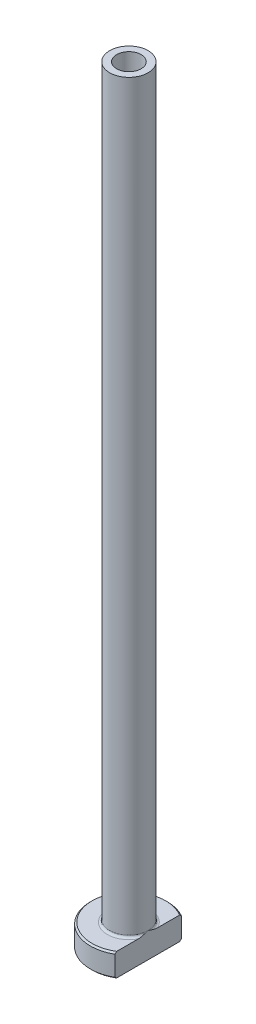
ISO-10303-21;
HEADER;
FILE_DESCRIPTION(('STEP AP214'),'2;1');
FILE_NAME('part.step','',(''),(''),'','','');
FILE_SCHEMA(('AUTOMOTIVE_DESIGN { 1 0 10303 214 1 1 1 1 }'));
ENDSEC;
DATA;
#1=APPLICATION_CONTEXT('core data for automotive mechanical design processes');
#2=APPLICATION_PROTOCOL_DEFINITION('international standard','automotive_design',2000,#1);
#3=PRODUCT_CONTEXT('',#1,'mechanical');
#4=PRODUCT('Part','Part','',(#3));
#5=PRODUCT_RELATED_PRODUCT_CATEGORY('part','',(#4));
#6=PRODUCT_DEFINITION_FORMATION('','',#4);
#7=PRODUCT_DEFINITION_CONTEXT('part definition',#1,'design');
#8=PRODUCT_DEFINITION('design','',#6,#7);
#9=PRODUCT_DEFINITION_SHAPE('','',#8);
#10=(LENGTH_UNIT() NAMED_UNIT(*) SI_UNIT(.MILLI.,.METRE.));
#11=(NAMED_UNIT(*) PLANE_ANGLE_UNIT() SI_UNIT($,.RADIAN.));
#12=(NAMED_UNIT(*) SI_UNIT($,.STERADIAN.) SOLID_ANGLE_UNIT());
#13=UNCERTAINTY_MEASURE_WITH_UNIT(LENGTH_MEASURE(1.E-05),#10,'distance_accuracy_value','');
#14=(GEOMETRIC_REPRESENTATION_CONTEXT(3) GLOBAL_UNCERTAINTY_ASSIGNED_CONTEXT((#13)) GLOBAL_UNIT_ASSIGNED_CONTEXT((#10,
#11,#12)) REPRESENTATION_CONTEXT('',''));
#15=CARTESIAN_POINT('',(0.,0.,0.));
#16=DIRECTION('',(0.,0.,1.));
#17=DIRECTION('',(1.,0.,0.));
#18=AXIS2_PLACEMENT_3D('',#15,#16,#17);
#19=CARTESIAN_POINT('',(0.,92.1876809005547,0.));
#20=DIRECTION('',(0.,1.,0.));
#21=DIRECTION('',(0.,0.,1.));
#22=AXIS2_PLACEMENT_3D('',#19,#20,#21);
#23=CYLINDRICAL_SURFACE('',#22,1.60000000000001);
#24=CARTESIAN_POINT('',(0.,100.,0.));
#25=DIRECTION('',(0.,1.,0.));
#26=DIRECTION('',(0.,0.,1.));
#27=AXIS2_PLACEMENT_3D('',#24,#25,#26);
#28=CIRCLE('',#27,1.60000000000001);
#29=CARTESIAN_POINT('',(0.,100.,1.60000000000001));
#30=VERTEX_POINT('',#29);
#31=EDGE_CURVE('E167',#30,#30,#28,.T.);
#32=ORIENTED_EDGE('',*,*,#31,.T.);
#33=EDGE_LOOP('',(#32));
#34=FACE_BOUND('',#33,.T.);
#35=CARTESIAN_POINT('',(0.,55.,0.));
#36=DIRECTION('',(0.,1.,0.));
#37=DIRECTION('',(0.,0.,1.));
#38=AXIS2_PLACEMENT_3D('',#35,#36,#37);
#39=CIRCLE('',#38,1.60000000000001);
#40=CARTESIAN_POINT('',(0.,55.,1.60000000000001));
#41=VERTEX_POINT('',#40);
#42=EDGE_CURVE('E170',#41,#41,#39,.T.);
#43=ORIENTED_EDGE('',*,*,#42,.F.);
#44=EDGE_LOOP('',(#43));
#45=FACE_BOUND('',#44,.T.);
#46=ADVANCED_FACE('F32',(#34,#45),#23,.F.);
#47=CARTESIAN_POINT('',(-1.60000000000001,100.,0.));
#48=DIRECTION('',(0.,1.,0.));
#49=DIRECTION('',(0.,0.,1.));
#50=AXIS2_PLACEMENT_3D('',#47,#48,#49);
#51=PLANE('',#50);
#52=CARTESIAN_POINT('',(0.,100.,0.));
#53=DIRECTION('',(0.,1.,0.));
#54=DIRECTION('',(0.,0.,1.));
#55=AXIS2_PLACEMENT_3D('',#52,#53,#54);
#56=CIRCLE('',#55,2.5);
#57=CARTESIAN_POINT('',(0.,100.,2.5));
#58=VERTEX_POINT('',#57);
#59=EDGE_CURVE('E174',#58,#58,#56,.T.);
#60=ORIENTED_EDGE('',*,*,#59,.T.);
#61=EDGE_LOOP('',(#60));
#62=FACE_BOUND('',#61,.T.);
#63=ORIENTED_EDGE('',*,*,#31,.F.);
#64=EDGE_LOOP('',(#63));
#65=FACE_BOUND('',#64,.T.);
#66=ADVANCED_FACE('F157',(#62,#65),#51,.T.);
#67=CARTESIAN_POINT('',(0.,92.1876809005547,0.));
#68=DIRECTION('',(0.,1.,0.));
#69=DIRECTION('',(0.,0.,1.));
#70=AXIS2_PLACEMENT_3D('',#67,#68,#69);
#71=CYLINDRICAL_SURFACE('',#70,2.49999999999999);
#72=CARTESIAN_POINT('',(0.,3.3,0.));
#73=DIRECTION('',(0.,1.,0.));
#74=DIRECTION('',(0.,0.,1.));
#75=AXIS2_PLACEMENT_3D('',#72,#73,#74);
#76=CIRCLE('',#75,2.49999999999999);
#77=CARTESIAN_POINT('',(2.49999999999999,3.3,0.));
#78=VERTEX_POINT('',#77);
#79=EDGE_CURVE('E180',#78,#78,#76,.T.);
#80=ORIENTED_EDGE('',*,*,#79,.T.);
#81=EDGE_LOOP('',(#80));
#82=FACE_BOUND('',#81,.T.);
#83=ORIENTED_EDGE('',*,*,#59,.F.);
#84=EDGE_LOOP('',(#83));
#85=FACE_BOUND('',#84,.T.);
#86=ADVANCED_FACE('F162',(#82,#85),#71,.T.);
#87=CARTESIAN_POINT('',(-2.49999999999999,3.,0.));
#88=DIRECTION('',(0.,1.,0.));
#89=DIRECTION('',(0.,0.,1.));
#90=AXIS2_PLACEMENT_3D('',#87,#88,#89);
#91=PLANE('',#90);
#92=DIRECTION('',(0.,0.,1.));
#93=VECTOR('',#92,1.);
#94=CARTESIAN_POINT('',(2.49999999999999,3.,0.));
#95=LINE('',#94,#93);
#96=CARTESIAN_POINT('',(2.49999999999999,3.,-4.09756024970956));
#97=VERTEX_POINT('',#96);
#98=CARTESIAN_POINT('',(2.49999999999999,3.,-1.26095202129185));
#99=VERTEX_POINT('',#98);
#100=EDGE_CURVE('E54',#97,#99,#95,.T.);
#101=ORIENTED_EDGE('',*,*,#100,.F.);
#102=CARTESIAN_POINT('',(0.,3.,0.));
#103=DIRECTION('',(0.,1.,0.));
#104=DIRECTION('',(0.,0.,1.));
#105=AXIS2_PLACEMENT_3D('',#102,#103,#104);
#106=CIRCLE('',#105,4.79999999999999);
#107=CARTESIAN_POINT('',(2.49999999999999,3.,4.09756024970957));
#108=VERTEX_POINT('',#107);
#109=EDGE_CURVE('E186',#97,#108,#106,.T.);
#110=ORIENTED_EDGE('',*,*,#109,.T.);
#111=CARTESIAN_POINT('',(2.49999999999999,3.,1.26095202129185));
#112=VERTEX_POINT('',#111);
#113=EDGE_CURVE('E134',#112,#108,#95,.T.);
#114=ORIENTED_EDGE('',*,*,#113,.F.);
#115=CARTESIAN_POINT('',(0.,3.,0.));
#116=DIRECTION('',(0.,1.,0.));
#117=DIRECTION('',(0.,0.,1.));
#118=AXIS2_PLACEMENT_3D('',#115,#116,#117);
#119=CIRCLE('',#118,2.79999999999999);
#120=EDGE_CURVE('E183',#112,#99,#119,.F.);
#121=ORIENTED_EDGE('',*,*,#120,.T.);
#122=EDGE_LOOP('',(#101,#110,#114,#121));
#123=FACE_BOUND('',#122,.T.);
#124=ADVANCED_FACE('F197',(#123),#91,.T.);
#125=CARTESIAN_POINT('',(0.,92.1876809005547,0.));
#126=DIRECTION('',(0.,1.,0.));
#127=DIRECTION('',(0.,0.,1.));
#128=AXIS2_PLACEMENT_3D('',#125,#126,#127);
#129=CYLINDRICAL_SURFACE('',#128,4.99999999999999);
#130=DIRECTION('',(0.,-1.,0.));
#131=VECTOR('',#130,1.);
#132=CARTESIAN_POINT('',(2.49999999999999,100.,4.33012701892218));
#133=LINE('',#132,#131);
#134=CARTESIAN_POINT('',(2.49999999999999,2.80000000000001,4.33012701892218));
#135=VERTEX_POINT('',#134);
#136=CARTESIAN_POINT('',(2.49999999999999,0.200000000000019,4.33012701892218));
#137=VERTEX_POINT('',#136);
#138=EDGE_CURVE('E82',#135,#137,#133,.T.);
#139=ORIENTED_EDGE('',*,*,#138,.F.);
#140=CARTESIAN_POINT('',(0.,2.80000000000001,0.));
#141=DIRECTION('',(0.,1.,0.));
#142=DIRECTION('',(0.,0.,1.));
#143=AXIS2_PLACEMENT_3D('',#140,#141,#142);
#144=CIRCLE('',#143,4.99999999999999);
#145=CARTESIAN_POINT('',(2.49999999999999,2.80000000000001,-4.33012701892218));
#146=VERTEX_POINT('',#145);
#147=EDGE_CURVE('E95',#135,#146,#144,.F.);
#148=ORIENTED_EDGE('',*,*,#147,.T.);
#149=DIRECTION('',(0.,-1.,0.));
#150=VECTOR('',#149,1.);
#151=CARTESIAN_POINT('',(2.49999999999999,100.,-4.33012701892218));
#152=LINE('',#151,#150);
#153=CARTESIAN_POINT('',(2.49999999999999,0.20000000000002,-4.33012701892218));
#154=VERTEX_POINT('',#153);
#155=EDGE_CURVE('E192',#146,#154,#152,.T.);
#156=ORIENTED_EDGE('',*,*,#155,.T.);
#157=CARTESIAN_POINT('',(0.,0.20000000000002,0.));
#158=DIRECTION('',(0.,-1.,0.));
#159=DIRECTION('',(0.,0.,-1.));
#160=AXIS2_PLACEMENT_3D('',#157,#158,#159);
#161=CIRCLE('',#160,4.99999999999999);
#162=EDGE_CURVE('E98',#154,#137,#161,.F.);
#163=ORIENTED_EDGE('',*,*,#162,.T.);
#164=EDGE_LOOP('',(#139,#148,#156,#163));
#165=FACE_BOUND('',#164,.T.);
#166=ADVANCED_FACE('F190',(#165),#129,.T.);
#167=CARTESIAN_POINT('',(-4.99999999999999,0.,0.));
#168=DIRECTION('',(0.,-1.,0.));
#169=DIRECTION('',(0.,0.,-1.));
#170=AXIS2_PLACEMENT_3D('',#167,#168,#169);
#171=PLANE('',#170);
#172=CARTESIAN_POINT('',(0.,0.,0.));
#173=DIRECTION('',(0.,-1.,0.));
#174=DIRECTION('',(0.,0.,-1.));
#175=AXIS2_PLACEMENT_3D('',#172,#173,#174);
#176=CIRCLE('',#175,2.34999999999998);
#177=CARTESIAN_POINT('',(0.,0.,-2.34999999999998));
#178=VERTEX_POINT('',#177);
#179=EDGE_CURVE('E40',#178,#178,#176,.F.);
#180=ORIENTED_EDGE('',*,*,#179,.T.);
#181=EDGE_LOOP('',(#180));
#182=FACE_BOUND('',#181,.T.);
#183=DIRECTION('',(0.,0.,-1.));
#184=VECTOR('',#183,1.);
#185=CARTESIAN_POINT('',(2.49999999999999,0.,4.33012701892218));
#186=LINE('',#185,#184);
#187=CARTESIAN_POINT('',(2.49999999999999,0.,4.09756024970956));
#188=VERTEX_POINT('',#187);
#189=CARTESIAN_POINT('',(2.49999999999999,0.,-4.09756024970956));
#190=VERTEX_POINT('',#189);
#191=EDGE_CURVE('E47',#188,#190,#186,.T.);
#192=ORIENTED_EDGE('',*,*,#191,.F.);
#193=CARTESIAN_POINT('',(0.,0.,0.));
#194=DIRECTION('',(0.,-1.,0.));
#195=DIRECTION('',(0.,0.,-1.));
#196=AXIS2_PLACEMENT_3D('',#193,#194,#195);
#197=CIRCLE('',#196,4.79999999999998);
#198=EDGE_CURVE('E92',#188,#190,#197,.T.);
#199=ORIENTED_EDGE('',*,*,#198,.T.);
#200=EDGE_LOOP('',(#192,#199));
#201=FACE_BOUND('',#200,.T.);
#202=ADVANCED_FACE('F91',(#182,#201),#171,.T.);
#203=CARTESIAN_POINT('',(0.,92.1876809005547,0.));
#204=DIRECTION('',(0.,1.,0.));
#205=DIRECTION('',(0.,0.,1.));
#206=AXIS2_PLACEMENT_3D('',#203,#204,#205);
#207=CYLINDRICAL_SURFACE('',#206,1.84999999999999);
#208=CARTESIAN_POINT('',(0.,0.499999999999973,0.));
#209=DIRECTION('',(0.,-1.,0.));
#210=DIRECTION('',(0.,0.,-1.));
#211=AXIS2_PLACEMENT_3D('',#208,#209,#210);
#212=CIRCLE('',#211,1.84999999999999);
#213=CARTESIAN_POINT('',(0.,0.499999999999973,-1.84999999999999));
#214=VERTEX_POINT('',#213);
#215=EDGE_CURVE('E11',#214,#214,#212,.T.);
#216=ORIENTED_EDGE('',*,*,#215,.T.);
#217=EDGE_LOOP('',(#216));
#218=FACE_BOUND('',#217,.T.);
#219=CARTESIAN_POINT('',(0.,43.,0.));
#220=DIRECTION('',(0.,1.,0.));
#221=DIRECTION('',(0.,0.,1.));
#222=AXIS2_PLACEMENT_3D('',#219,#220,#221);
#223=CIRCLE('',#222,1.85);
#224=CARTESIAN_POINT('',(0.,43.,1.85));
#225=VERTEX_POINT('',#224);
#226=EDGE_CURVE('E172',#225,#225,#223,.T.);
#227=ORIENTED_EDGE('',*,*,#226,.T.);
#228=EDGE_LOOP('',(#227));
#229=FACE_BOUND('',#228,.T.);
#230=ADVANCED_FACE('F215',(#218,#229),#207,.F.);
#231=CARTESIAN_POINT('',(0.,43.,0.));
#232=DIRECTION('',(0.,-1.,0.));
#233=DIRECTION('',(0.,0.,-1.));
#234=AXIS2_PLACEMENT_3D('',#231,#232,#233);
#235=CONICAL_SURFACE('',#234,1.85,0.020830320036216);
#236=ORIENTED_EDGE('',*,*,#42,.T.);
#237=EDGE_LOOP('',(#236));
#238=FACE_BOUND('',#237,.T.);
#239=ORIENTED_EDGE('',*,*,#226,.F.);
#240=EDGE_LOOP('',(#239));
#241=FACE_BOUND('',#240,.T.);
#242=ADVANCED_FACE('F111',(#238,#241),#235,.F.);
#243=CARTESIAN_POINT('',(0.,3.3,0.));
#244=DIRECTION('',(0.,1.,0.));
#245=DIRECTION('',(0.,0.,1.));
#246=AXIS2_PLACEMENT_3D('',#243,#244,#245);
#247=TOROIDAL_SURFACE('',#246,2.79999999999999,0.3);
#248=ORIENTED_EDGE('',*,*,#120,.F.);
#249=CARTESIAN_POINT('',(2.49999999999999,3.3,0.));
#250=CARTESIAN_POINT('',(2.49999999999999,3.30000062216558,-4.84266777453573E-11));
#251=CARTESIAN_POINT('',(2.49999999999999,3.3000012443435,1.59620968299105E-07));
#252=CARTESIAN_POINT('',(2.49999999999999,3.3000024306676,6.45477755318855E-07));
#253=CARTESIAN_POINT('',(2.49999999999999,3.30000299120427,9.78480438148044E-07));
#254=CARTESIAN_POINT('',(2.49999999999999,3.30000411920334,1.77471942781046E-06));
#255=CARTESIAN_POINT('',(2.49999999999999,3.30000467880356,2.24902099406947E-06));
#256=CARTESIAN_POINT('',(2.49999999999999,3.30000572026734,3.25953628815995E-06));
#257=CARTESIAN_POINT('',(2.49999999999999,3.30000620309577,3.79480690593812E-06));
#258=CARTESIAN_POINT('',(2.49999999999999,3.30000787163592,5.75794557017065E-06));
#259=CARTESIAN_POINT('',(2.49999999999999,3.30000896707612,7.2642403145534E-06));
#260=CARTESIAN_POINT('',(2.49999999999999,3.30001087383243,1.0336112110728E-05));
#261=CARTESIAN_POINT('',(2.49999999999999,3.30001169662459,1.18949491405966E-05));
#262=CARTESIAN_POINT('',(2.49999999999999,3.30001489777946,1.81400839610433E-05));
#263=CARTESIAN_POINT('',(2.49999999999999,3.30001712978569,2.29062162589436E-05));
#264=CARTESIAN_POINT('',(2.49999999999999,3.30002067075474,3.21793848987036E-05));
#265=CARTESIAN_POINT('',(2.49999999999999,3.30002205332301,3.66588971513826E-05));
#266=CARTESIAN_POINT('',(2.49999999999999,3.30002810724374,5.61718377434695E-05));
#267=CARTESIAN_POINT('',(2.49999999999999,3.30003284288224,7.11735829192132E-05));
#268=CARTESIAN_POINT('',(2.49999999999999,3.30004025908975,9.89920283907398E-05));
#269=CARTESIAN_POINT('',(2.49999999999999,3.3000431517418,0.000111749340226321));
#270=CARTESIAN_POINT('',(2.49999999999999,3.30006652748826,0.000206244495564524));
#271=CARTESIAN_POINT('',(2.49999999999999,3.3000969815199,0.00028511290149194));
#272=CARTESIAN_POINT('',(2.49999999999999,3.30021213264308,0.000594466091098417));
#273=CARTESIAN_POINT('',(2.49999999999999,3.30028938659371,0.000826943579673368));
#274=CARTESIAN_POINT('',(2.49999999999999,3.30059681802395,0.00173885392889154));
#275=CARTESIAN_POINT('',(2.49999999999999,3.3008347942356,0.00241625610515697));
#276=CARTESIAN_POINT('',(2.49999999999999,3.3018119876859,0.00521069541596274));
#277=CARTESIAN_POINT('',(2.49999999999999,3.30254240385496,0.00732996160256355));
#278=CARTESIAN_POINT('',(2.49999999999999,3.3122604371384,0.0355096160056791));
#279=CARTESIAN_POINT('',(2.49999999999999,3.32130808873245,0.0615551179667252));
#280=CARTESIAN_POINT('',(2.49999999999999,3.33896212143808,0.11267798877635));
#281=CARTESIAN_POINT('',(2.49999999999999,3.34757212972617,0.137754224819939));
#282=CARTESIAN_POINT('',(2.49999999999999,3.36573068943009,0.190981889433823));
#283=CARTESIAN_POINT('',(2.49999999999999,3.37526654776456,0.219137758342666));
#284=CARTESIAN_POINT('',(2.49999999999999,3.39422867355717,0.275816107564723));
#285=CARTESIAN_POINT('',(2.49999999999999,3.40365272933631,0.304339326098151));
#286=CARTESIAN_POINT('',(2.49999999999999,3.42641697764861,0.374416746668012));
#287=CARTESIAN_POINT('',(2.49999999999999,3.43959811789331,0.416023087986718));
#288=CARTESIAN_POINT('',(2.49999999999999,3.46479157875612,0.498481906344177));
#289=CARTESIAN_POINT('',(2.49999999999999,3.4768245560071,0.539328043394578));
#290=CARTESIAN_POINT('',(2.49999999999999,3.50224427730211,0.629981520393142));
#291=CARTESIAN_POINT('',(2.49999999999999,3.51538048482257,0.679860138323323));
#292=CARTESIAN_POINT('',(2.49999999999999,3.53964074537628,0.780511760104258));
#293=CARTESIAN_POINT('',(2.49999999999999,3.55074877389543,0.831288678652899));
#294=CARTESIAN_POINT('',(2.49999999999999,3.57087054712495,0.937063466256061));
#295=CARTESIAN_POINT('',(2.49999999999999,3.57967623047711,0.992102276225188));
#296=CARTESIAN_POINT('',(2.49999999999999,3.59301148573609,1.10256024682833));
#297=CARTESIAN_POINT('',(2.49999999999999,3.59755297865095,1.1579779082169));
#298=CARTESIAN_POINT('',(2.49999999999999,3.60093314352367,1.26786705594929));
#299=CARTESIAN_POINT('',(2.49999999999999,3.59989366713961,1.32233291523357));
#300=CARTESIAN_POINT('',(2.49999999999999,3.59277279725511,1.40310062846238));
#301=CARTESIAN_POINT('',(2.49999999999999,3.58952137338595,1.42965222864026));
#302=CARTESIAN_POINT('',(2.49999999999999,3.58085857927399,1.48239078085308));
#303=CARTESIAN_POINT('',(2.49999999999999,3.57544928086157,1.50857805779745));
#304=CARTESIAN_POINT('',(2.49999999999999,3.56298810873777,1.5565879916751));
#305=CARTESIAN_POINT('',(2.49999999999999,3.55628200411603,1.57849902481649));
#306=CARTESIAN_POINT('',(2.49999999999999,3.54055393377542,1.62160292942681));
#307=CARTESIAN_POINT('',(2.49999999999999,3.53152220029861,1.64279233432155));
#308=CARTESIAN_POINT('',(2.49999999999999,3.51057199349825,1.68404469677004));
#309=CARTESIAN_POINT('',(2.49999999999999,3.49862012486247,1.70409105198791));
#310=CARTESIAN_POINT('',(2.49999999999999,3.47134074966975,1.74172093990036));
#311=CARTESIAN_POINT('',(2.49999999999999,3.45603127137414,1.75931683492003));
#312=CARTESIAN_POINT('',(2.49999999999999,3.42979930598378,1.78297070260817));
#313=CARTESIAN_POINT('',(2.49999999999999,3.42024268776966,1.79054141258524));
#314=CARTESIAN_POINT('',(2.49999999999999,3.40009035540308,1.8041699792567));
#315=CARTESIAN_POINT('',(2.49999999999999,3.38949499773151,1.8102283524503));
#316=CARTESIAN_POINT('',(2.49999999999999,3.36727740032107,1.82047087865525));
#317=CARTESIAN_POINT('',(2.49999999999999,3.35564531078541,1.8246340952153));
#318=CARTESIAN_POINT('',(2.49999999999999,3.33178837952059,1.83058442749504));
#319=CARTESIAN_POINT('',(2.49999999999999,3.31956435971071,1.83237474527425));
#320=CARTESIAN_POINT('',(2.49999999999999,3.29665736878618,1.83331852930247));
#321=CARTESIAN_POINT('',(2.49999999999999,3.28598670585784,1.8327923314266));
#322=CARTESIAN_POINT('',(2.49999999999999,3.26490749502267,1.82986307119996));
#323=CARTESIAN_POINT('',(2.49999999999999,3.25449899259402,1.82745968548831));
#324=CARTESIAN_POINT('',(2.49999999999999,3.23467098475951,1.82111257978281));
#325=CARTESIAN_POINT('',(2.49999999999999,3.22522816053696,1.81724026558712));
#326=CARTESIAN_POINT('',(2.49999999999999,3.20699535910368,1.80819497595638));
#327=CARTESIAN_POINT('',(2.49999999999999,3.19820556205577,1.80302164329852));
#328=CARTESIAN_POINT('',(2.49999999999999,3.17663162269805,1.78842115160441));
#329=CARTESIAN_POINT('',(2.49999999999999,3.16436228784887,1.77823293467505));
#330=CARTESIAN_POINT('',(2.49999999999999,3.14157828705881,1.75604629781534));
#331=CARTESIAN_POINT('',(2.49999999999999,3.13106906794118,1.74404246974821));
#332=CARTESIAN_POINT('',(2.49999999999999,3.10600520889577,1.71142114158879));
#333=CARTESIAN_POINT('',(2.49999999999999,3.09267476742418,1.68986887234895));
#334=CARTESIAN_POINT('',(2.49999999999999,3.06940323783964,1.64508572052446));
#335=CARTESIAN_POINT('',(2.49999999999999,3.05946314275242,1.62185434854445));
#336=CARTESIAN_POINT('',(2.49999999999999,3.03545750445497,1.55546754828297));
#337=CARTESIAN_POINT('',(2.49999999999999,3.02444022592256,1.51122187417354));
#338=CARTESIAN_POINT('',(2.49999999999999,3.00863926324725,1.42119777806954));
#339=CARTESIAN_POINT('',(2.49999999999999,3.00393876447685,1.3754068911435));
#340=CARTESIAN_POINT('',(2.49999999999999,2.99924212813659,1.28072198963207));
#341=CARTESIAN_POINT('',(2.49999999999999,2.99956098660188,1.23181420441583));
#342=CARTESIAN_POINT('',(2.49999999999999,3.00436098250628,1.13410944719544));
#343=CARTESIAN_POINT('',(2.49999999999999,3.00885327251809,1.08531312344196));
#344=CARTESIAN_POINT('',(2.49999999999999,3.02074191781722,0.990773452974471));
#345=CARTESIAN_POINT('',(2.49999999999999,3.02796792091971,0.945007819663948));
#346=CARTESIAN_POINT('',(2.49999999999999,3.04465555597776,0.854199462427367));
#347=CARTESIAN_POINT('',(2.49999999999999,3.05410250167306,0.809153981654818));
#348=CARTESIAN_POINT('',(2.49999999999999,3.07710029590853,0.709411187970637));
#349=CARTESIAN_POINT('',(2.49999999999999,3.09109633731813,0.65481771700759));
#350=CARTESIAN_POINT('',(2.49999999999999,3.12140740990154,0.544863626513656));
#351=CARTESIAN_POINT('',(2.49999999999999,3.13777040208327,0.489516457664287));
#352=CARTESIAN_POINT('',(2.49999999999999,3.16649540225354,0.39674060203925));
#353=CARTESIAN_POINT('',(2.49999999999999,3.17848130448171,0.359193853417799));
#354=CARTESIAN_POINT('',(2.49999999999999,3.20280507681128,0.284651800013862));
#355=CARTESIAN_POINT('',(2.49999999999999,3.21513791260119,0.247654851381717));
#356=CARTESIAN_POINT('',(2.49999999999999,3.23873713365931,0.177767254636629));
#357=CARTESIAN_POINT('',(2.49999999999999,3.24997409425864,0.144866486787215));
#358=CARTESIAN_POINT('',(2.49999999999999,3.27307149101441,0.0777985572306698));
#359=CARTESIAN_POINT('',(2.49999999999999,3.28493883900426,0.043633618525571));
#360=CARTESIAN_POINT('',(2.49999999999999,3.29745794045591,0.00732879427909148));
#361=CARTESIAN_POINT('',(2.49999999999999,3.29818879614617,0.00520838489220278));
#362=CARTESIAN_POINT('',(2.49999999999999,3.29916610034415,0.00241367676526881));
#363=CARTESIAN_POINT('',(2.49999999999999,3.29940376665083,0.00173715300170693));
#364=CARTESIAN_POINT('',(2.49999999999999,3.29971082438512,0.000826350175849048));
#365=CARTESIAN_POINT('',(2.49999999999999,3.29978800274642,0.00059409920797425));
#366=CARTESIAN_POINT('',(2.49999999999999,3.29990305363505,0.000285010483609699));
#367=CARTESIAN_POINT('',(2.49999999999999,3.29993349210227,0.000206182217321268));
#368=CARTESIAN_POINT('',(2.49999999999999,3.29995685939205,0.000111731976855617));
#369=CARTESIAN_POINT('',(2.49999999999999,3.29995975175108,9.89774272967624E-05));
#370=CARTESIAN_POINT('',(2.49999999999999,3.29996716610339,7.11651841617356E-05));
#371=CARTESIAN_POINT('',(2.49999999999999,3.29997189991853,5.61668063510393E-05));
#372=CARTESIAN_POINT('',(2.49999999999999,3.29997795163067,3.6657630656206E-05));
#373=CARTESIAN_POINT('',(2.49999999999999,3.29997933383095,3.21785222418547E-05));
#374=CARTESIAN_POINT('',(2.49999999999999,3.29998287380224,2.29061355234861E-05));
#375=CARTESIAN_POINT('',(2.49999999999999,3.29998510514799,1.81403645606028E-05));
#376=CARTESIAN_POINT('',(2.49999999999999,3.29998830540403,1.18955812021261E-05));
#377=CARTESIAN_POINT('',(2.49999999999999,3.29998912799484,1.03367751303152E-05));
#378=CARTESIAN_POINT('',(2.49999999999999,3.29999103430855,7.26492686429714E-06));
#379=CARTESIAN_POINT('',(2.49999999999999,3.29999212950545,5.7586219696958E-06));
#380=CARTESIAN_POINT('',(2.49999999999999,3.29999379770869,3.79542405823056E-06));
#381=CARTESIAN_POINT('',(2.49999999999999,3.29999428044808,3.26012700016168E-06));
#382=CARTESIAN_POINT('',(2.49999999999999,3.29999532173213,2.24954279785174E-06));
#383=CARTESIAN_POINT('',(2.49999999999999,3.29999588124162,1.77519848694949E-06));
#384=CARTESIAN_POINT('',(2.49999999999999,3.2999970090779,9.78856773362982E-07));
#385=CARTESIAN_POINT('',(2.49999999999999,3.29999756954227,6.45796803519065E-07));
#386=CARTESIAN_POINT('',(2.49999999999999,3.29999875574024,1.59799504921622E-07));
#387=CARTESIAN_POINT('',(2.49999999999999,3.29999937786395,4.84248791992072E-11));
#388=CARTESIAN_POINT('',(2.49999999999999,3.3,0.));
#389=B_SPLINE_CURVE_WITH_KNOTS('',3,(#249,#250,#251,#252,#253,#254,#255,#256,#257,#258,#259,
#260,#261,#262,#263,#264,#265,#266,#267,#268,#269,#270,#271,#272,#273,#274,#275,#276,#277,#278,
#279,#280,#281,#282,#283,#284,#285,#286,#287,#288,#289,#290,#291,#292,#293,#294,#295,#296,#297,
#298,#299,#300,#301,#302,#303,#304,#305,#306,#307,#308,#309,#310,#311,#312,#313,#314,#315,#316,
#317,#318,#319,#320,#321,#322,#323,#324,#325,#326,#327,#328,#329,#330,#331,#332,#333,#334,#335,
#336,#337,#338,#339,#340,#341,#342,#343,#344,#345,#346,#347,#348,#349,#350,#351,#352,#353,#354,
#355,#356,#357,#358,#359,#360,#361,#362,#363,#364,#365,#366,#367,#368,#369,#370,#371,#372,#373,
#374,#375,#376,#377,#378,#379,#380,#381,#382,#383,#384,#385,#386,#387,#388),.UNSPECIFIED.,.T.,
.F.,(4,2,2,2,2,2,2,2,2,2,2,2,2,2,2,2,2,2,2,2,2,2,2,2,2,2,2,2,2,2,2,2,2,2,2,2,2,2,2,2,2,2,2,2,2,
2,2,2,2,2,2,2,2,2,2,2,2,2,2,2,2,2,2,2,2,2,2,2,2,4),(0.,1.86789324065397E-06,
3.81549782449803E-06,6.00610697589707E-06,8.16653256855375E-06,1.37285624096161E-05,
1.90122213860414E-05,3.47597333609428E-05,4.88082673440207E-05,9.59978487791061E-05,
0.000135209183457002,0.000388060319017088,0.0011236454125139,0.00327678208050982,
0.0100024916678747,0.0927120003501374,0.172253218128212,0.26143263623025,0.351551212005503,
0.482477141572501,0.610212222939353,0.764915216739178,0.92079209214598,1.0878789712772,
1.25449733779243,1.41749285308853,1.49767530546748,1.57778095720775,1.64642481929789,
1.7153618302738,1.7851275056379,1.85452737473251,1.89099315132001,1.92744645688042,
1.96429324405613,2.00109025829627,2.03297105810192,2.06485735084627,2.09535926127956,
2.12586955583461,2.17344034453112,2.22115572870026,2.29675134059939,2.37236907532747,
2.50839721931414,2.6461997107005,2.79268284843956,2.93955855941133,3.07848421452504,
3.2165158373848,3.38554045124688,3.5586593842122,3.67689643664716,3.79388863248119,
3.89819085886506,4.0066832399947,4.01341261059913,4.01556295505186,4.01629782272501,
4.0165505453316,4.01658974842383,4.01663692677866,4.01665097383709,4.01666671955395,
4.01667200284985,4.01667756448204,4.01667972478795,4.01668191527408,4.01668386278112,
4.01668573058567),.UNSPECIFIED.);
#390=EDGE_CURVE('E126',#112,#78,#389,.T.);
#391=ORIENTED_EDGE('',*,*,#390,.T.);
#392=ORIENTED_EDGE('',*,*,#79,.F.);
#393=CARTESIAN_POINT('',(2.49999999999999,3.3,0.));
#394=CARTESIAN_POINT('',(2.49999999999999,3.29999937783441,4.84272521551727E-11));
#395=CARTESIAN_POINT('',(2.49999999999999,3.2999987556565,-1.59620967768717E-07));
#396=CARTESIAN_POINT('',(2.49999999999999,3.29999756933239,-6.45477754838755E-07));
#397=CARTESIAN_POINT('',(2.49999999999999,3.29999700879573,-9.78480437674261E-07));
#398=CARTESIAN_POINT('',(2.49999999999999,3.29999588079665,-1.77471942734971E-06));
#399=CARTESIAN_POINT('',(2.49999999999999,3.29999532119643,-2.24902099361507E-06));
#400=CARTESIAN_POINT('',(2.49999999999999,3.29999427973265,-3.25953628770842E-06));
#401=CARTESIAN_POINT('',(2.49999999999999,3.29999379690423,-3.79480690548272E-06));
#402=CARTESIAN_POINT('',(2.49999999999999,3.29999212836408,-5.75794556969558E-06));
#403=CARTESIAN_POINT('',(2.49999999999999,3.29999103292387,-7.26424031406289E-06));
#404=CARTESIAN_POINT('',(2.49999999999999,3.29998912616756,-1.0336112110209E-05));
#405=CARTESIAN_POINT('',(2.49999999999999,3.2999883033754,-1.18949491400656E-05));
#406=CARTESIAN_POINT('',(2.49999999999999,3.29998510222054,-1.81400839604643E-05));
#407=CARTESIAN_POINT('',(2.49999999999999,3.29998287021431,-2.29062162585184E-05));
#408=CARTESIAN_POINT('',(2.49999999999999,3.29997932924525,-3.21793848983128E-05));
#409=CARTESIAN_POINT('',(2.49999999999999,3.29997794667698,-3.66588971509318E-05));
#410=CARTESIAN_POINT('',(2.49999999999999,3.29997189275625,-5.61718377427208E-05));
#411=CARTESIAN_POINT('',(2.49999999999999,3.29996715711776,-7.11735829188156E-05));
#412=CARTESIAN_POINT('',(2.49999999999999,3.29995974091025,-9.89920283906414E-05));
#413=CARTESIAN_POINT('',(2.49999999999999,3.29995684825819,-0.000111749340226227));
#414=CARTESIAN_POINT('',(2.49999999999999,3.29993347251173,-0.000206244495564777));
#415=CARTESIAN_POINT('',(2.49999999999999,3.2999030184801,-0.000285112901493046));
#416=CARTESIAN_POINT('',(2.49999999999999,3.29978786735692,-0.000594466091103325));
#417=CARTESIAN_POINT('',(2.49999999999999,3.29971061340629,-0.000826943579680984));
#418=CARTESIAN_POINT('',(2.49999999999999,3.29940318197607,-0.00173885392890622));
#419=CARTESIAN_POINT('',(2.49999999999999,3.29916520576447,-0.00241625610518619));
#420=CARTESIAN_POINT('',(2.49999999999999,3.2981880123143,-0.00521069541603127));
#421=CARTESIAN_POINT('',(2.49999999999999,3.29745759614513,-0.00732996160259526));
#422=CARTESIAN_POINT('',(2.49999999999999,3.28773956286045,-0.0355096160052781));
#423=CARTESIAN_POINT('',(2.49999999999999,3.27869191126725,-0.0615551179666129));
#424=CARTESIAN_POINT('',(2.49999999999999,3.26103787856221,-0.112677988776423));
#425=CARTESIAN_POINT('',(2.49999999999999,3.25242787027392,-0.137754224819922));
#426=CARTESIAN_POINT('',(2.49999999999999,3.23426931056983,-0.190981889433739));
#427=CARTESIAN_POINT('',(2.49999999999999,3.22473345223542,-0.219137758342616));
#428=CARTESIAN_POINT('',(2.49999999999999,3.20577132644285,-0.275816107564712));
#429=CARTESIAN_POINT('',(2.49999999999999,3.1963472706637,-0.304339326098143));
#430=CARTESIAN_POINT('',(2.49999999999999,3.17358302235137,-0.374416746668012));
#431=CARTESIAN_POINT('',(2.49999999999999,3.16040188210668,-0.416023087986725));
#432=CARTESIAN_POINT('',(2.49999999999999,3.13520842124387,-0.498481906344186));
#433=CARTESIAN_POINT('',(2.49999999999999,3.1231754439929,-0.539328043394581));
#434=CARTESIAN_POINT('',(2.49999999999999,3.09775572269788,-0.629981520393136));
#435=CARTESIAN_POINT('',(2.49999999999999,3.08461951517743,-0.679860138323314));
#436=CARTESIAN_POINT('',(2.49999999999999,3.06035925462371,-0.780511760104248));
#437=CARTESIAN_POINT('',(2.49999999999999,3.04925122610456,-0.831288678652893));
#438=CARTESIAN_POINT('',(2.49999999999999,3.02912945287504,-0.93706346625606));
#439=CARTESIAN_POINT('',(2.49999999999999,3.02032376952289,-0.99210227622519));
#440=CARTESIAN_POINT('',(2.49999999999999,3.0069885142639,-1.10256024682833));
#441=CARTESIAN_POINT('',(2.49999999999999,3.00244702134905,-1.1579779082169));
#442=CARTESIAN_POINT('',(2.49999999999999,2.99906685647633,-1.26786705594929));
#443=CARTESIAN_POINT('',(2.49999999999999,3.00010633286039,-1.32233291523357));
#444=CARTESIAN_POINT('',(2.49999999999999,3.00722720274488,-1.40310062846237));
#445=CARTESIAN_POINT('',(2.49999999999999,3.01047862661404,-1.42965222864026));
#446=CARTESIAN_POINT('',(2.49999999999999,3.019141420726,-1.48239078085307));
#447=CARTESIAN_POINT('',(2.49999999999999,3.02455071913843,-1.50857805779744));
#448=CARTESIAN_POINT('',(2.49999999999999,3.03701189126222,-1.5565879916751));
#449=CARTESIAN_POINT('',(2.49999999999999,3.04371799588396,-1.57849902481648));
#450=CARTESIAN_POINT('',(2.49999999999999,3.05944606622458,-1.62160292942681));
#451=CARTESIAN_POINT('',(2.49999999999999,3.06847779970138,-1.64279233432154));
#452=CARTESIAN_POINT('',(2.49999999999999,3.08942800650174,-1.68404469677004));
#453=CARTESIAN_POINT('',(2.49999999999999,3.10137987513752,-1.7040910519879));
#454=CARTESIAN_POINT('',(2.49999999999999,3.12865925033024,-1.74172093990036));
#455=CARTESIAN_POINT('',(2.49999999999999,3.14396872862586,-1.75931683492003));
#456=CARTESIAN_POINT('',(2.49999999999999,3.17020069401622,-1.78297070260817));
#457=CARTESIAN_POINT('',(2.49999999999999,3.17975731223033,-1.79054141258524));
#458=CARTESIAN_POINT('',(2.49999999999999,3.19990964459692,-1.8041699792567));
#459=CARTESIAN_POINT('',(2.49999999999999,3.21050500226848,-1.8102283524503));
#460=CARTESIAN_POINT('',(2.49999999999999,3.23272259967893,-1.82047087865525));
#461=CARTESIAN_POINT('',(2.49999999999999,3.24435468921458,-1.8246340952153));
#462=CARTESIAN_POINT('',(2.49999999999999,3.2682116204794,-1.83058442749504));
#463=CARTESIAN_POINT('',(2.49999999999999,3.28043564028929,-1.83237474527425));
#464=CARTESIAN_POINT('',(2.49999999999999,3.30334263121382,-1.83331852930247));
#465=CARTESIAN_POINT('',(2.49999999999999,3.31401329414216,-1.8327923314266));
#466=CARTESIAN_POINT('',(2.49999999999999,3.33509250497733,-1.82986307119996));
#467=CARTESIAN_POINT('',(2.49999999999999,3.34550100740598,-1.82745968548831));
#468=CARTESIAN_POINT('',(2.49999999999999,3.36532901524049,-1.82111257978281));
#469=CARTESIAN_POINT('',(2.49999999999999,3.37477183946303,-1.81724026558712));
#470=CARTESIAN_POINT('',(2.49999999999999,3.39300464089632,-1.80819497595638));
#471=CARTESIAN_POINT('',(2.49999999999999,3.40179443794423,-1.80302164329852));
#472=CARTESIAN_POINT('',(2.49999999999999,3.42336837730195,-1.78842115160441));
#473=CARTESIAN_POINT('',(2.49999999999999,3.43563771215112,-1.77823293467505));
#474=CARTESIAN_POINT('',(2.49999999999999,3.45842171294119,-1.75604629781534));
#475=CARTESIAN_POINT('',(2.49999999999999,3.46893093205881,-1.74404246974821));
#476=CARTESIAN_POINT('',(2.49999999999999,3.49399479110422,-1.71142114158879));
#477=CARTESIAN_POINT('',(2.49999999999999,3.50732523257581,-1.68986887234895));
#478=CARTESIAN_POINT('',(2.49999999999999,3.53059676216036,-1.64508572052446));
#479=CARTESIAN_POINT('',(2.49999999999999,3.54053685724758,-1.62185434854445));
#480=CARTESIAN_POINT('',(2.49999999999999,3.56454249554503,-1.55546754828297));
#481=CARTESIAN_POINT('',(2.49999999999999,3.57555977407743,-1.51122187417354));
#482=CARTESIAN_POINT('',(2.49999999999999,3.59136073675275,-1.42119777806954));
#483=CARTESIAN_POINT('',(2.49999999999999,3.59606123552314,-1.37540689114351));
#484=CARTESIAN_POINT('',(2.49999999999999,3.6007578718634,-1.28072198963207));
#485=CARTESIAN_POINT('',(2.49999999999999,3.60043901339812,-1.23181420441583));
#486=CARTESIAN_POINT('',(2.49999999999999,3.59563901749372,-1.13410944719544));
#487=CARTESIAN_POINT('',(2.49999999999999,3.59114672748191,-1.08531312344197));
#488=CARTESIAN_POINT('',(2.49999999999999,3.57925808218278,-0.990773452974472));
#489=CARTESIAN_POINT('',(2.49999999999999,3.57203207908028,-0.945007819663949));
#490=CARTESIAN_POINT('',(2.49999999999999,3.55534444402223,-0.854199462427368));
#491=CARTESIAN_POINT('',(2.49999999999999,3.54589749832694,-0.809153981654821));
#492=CARTESIAN_POINT('',(2.49999999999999,3.52289970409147,-0.709411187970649));
#493=CARTESIAN_POINT('',(2.49999999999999,3.50890366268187,-0.654817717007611));
#494=CARTESIAN_POINT('',(2.49999999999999,3.47859259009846,-0.544863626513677));
#495=CARTESIAN_POINT('',(2.49999999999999,3.46222959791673,-0.489516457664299));
#496=CARTESIAN_POINT('',(2.49999999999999,3.43350459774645,-0.396740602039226));
#497=CARTESIAN_POINT('',(2.49999999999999,3.42151869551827,-0.35919385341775));
#498=CARTESIAN_POINT('',(2.49999999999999,3.39719492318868,-0.284651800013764));
#499=CARTESIAN_POINT('',(2.49999999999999,3.38486208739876,-0.247654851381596));
#500=CARTESIAN_POINT('',(2.49999999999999,3.36126286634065,-0.1777672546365));
#501=CARTESIAN_POINT('',(2.49999999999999,3.35002590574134,-0.144866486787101));
#502=CARTESIAN_POINT('',(2.49999999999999,3.32692850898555,-0.0777985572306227));
#503=CARTESIAN_POINT('',(2.49999999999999,3.31506116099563,-0.0436336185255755));
#504=CARTESIAN_POINT('',(2.49999999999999,3.30254205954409,-0.00732879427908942));
#505=CARTESIAN_POINT('',(2.49999999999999,3.30181120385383,-0.00520838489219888));
#506=CARTESIAN_POINT('',(2.49999999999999,3.30083389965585,-0.00241367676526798));
#507=CARTESIAN_POINT('',(2.49999999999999,3.30059623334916,-0.00173715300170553));
#508=CARTESIAN_POINT('',(2.49999999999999,3.30028917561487,-0.000826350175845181));
#509=CARTESIAN_POINT('',(2.49999999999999,3.30021199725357,-0.000594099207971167));
#510=CARTESIAN_POINT('',(2.49999999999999,3.30009694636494,-0.000285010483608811));
#511=CARTESIAN_POINT('',(2.49999999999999,3.30006650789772,-0.000206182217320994));
#512=CARTESIAN_POINT('',(2.49999999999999,3.30004314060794,-0.000111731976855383));
#513=CARTESIAN_POINT('',(2.49999999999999,3.30004024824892,-9.89774272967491E-05));
#514=CARTESIAN_POINT('',(2.49999999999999,3.3000328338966,-7.11651841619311E-05));
#515=CARTESIAN_POINT('',(2.49999999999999,3.30002810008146,-5.61668063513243E-05));
#516=CARTESIAN_POINT('',(2.49999999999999,3.30002204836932,-3.66576306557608E-05));
#517=CARTESIAN_POINT('',(2.49999999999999,3.30002066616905,-3.21785222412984E-05));
#518=CARTESIAN_POINT('',(2.49999999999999,3.30001712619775,-2.29061355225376E-05));
#519=CARTESIAN_POINT('',(2.49999999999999,3.300014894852,-1.81403645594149E-05));
#520=CARTESIAN_POINT('',(2.49999999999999,3.30001169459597,-1.1895581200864E-05));
#521=CARTESIAN_POINT('',(2.49999999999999,3.30001087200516,-1.03367751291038E-05));
#522=CARTESIAN_POINT('',(2.49999999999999,3.30000896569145,-7.26492686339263E-06));
#523=CARTESIAN_POINT('',(2.49999999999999,3.30000787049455,-5.7586219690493E-06));
#524=CARTESIAN_POINT('',(2.49999999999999,3.3000062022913,-3.79542405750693E-06));
#525=CARTESIAN_POINT('',(2.49999999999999,3.30000571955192,-3.26012699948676E-06));
#526=CARTESIAN_POINT('',(2.49999999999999,3.30000467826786,-2.24954279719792E-06));
#527=CARTESIAN_POINT('',(2.49999999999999,3.30000411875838,-1.77519848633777E-06));
#528=CARTESIAN_POINT('',(2.49999999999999,3.3000029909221,-9.78856772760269E-07));
#529=CARTESIAN_POINT('',(2.49999999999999,3.30000243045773,-6.45796802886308E-07));
#530=CARTESIAN_POINT('',(2.49999999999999,3.30000124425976,-1.59799504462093E-07));
#531=CARTESIAN_POINT('',(2.49999999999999,3.30000062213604,-4.84244520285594E-11));
#532=CARTESIAN_POINT('',(2.49999999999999,3.3,0.));
#533=B_SPLINE_CURVE_WITH_KNOTS('',3,(#393,#394,#395,#396,#397,#398,#399,#400,#401,#402,#403,
#404,#405,#406,#407,#408,#409,#410,#411,#412,#413,#414,#415,#416,#417,#418,#419,#420,#421,#422,
#423,#424,#425,#426,#427,#428,#429,#430,#431,#432,#433,#434,#435,#436,#437,#438,#439,#440,#441,
#442,#443,#444,#445,#446,#447,#448,#449,#450,#451,#452,#453,#454,#455,#456,#457,#458,#459,#460,
#461,#462,#463,#464,#465,#466,#467,#468,#469,#470,#471,#472,#473,#474,#475,#476,#477,#478,#479,
#480,#481,#482,#483,#484,#485,#486,#487,#488,#489,#490,#491,#492,#493,#494,#495,#496,#497,#498,
#499,#500,#501,#502,#503,#504,#505,#506,#507,#508,#509,#510,#511,#512,#513,#514,#515,#516,#517,
#518,#519,#520,#521,#522,#523,#524,#525,#526,#527,#528,#529,#530,#531,#532),.UNSPECIFIED.,.T.,
.F.,(4,2,2,2,2,2,2,2,2,2,2,2,2,2,2,2,2,2,2,2,2,2,2,2,2,2,2,2,2,2,2,2,2,2,2,2,2,2,2,2,2,2,2,2,2,
2,2,2,2,2,2,2,2,2,2,2,2,2,2,2,2,2,2,2,2,2,2,2,2,4),(0.,1.86789324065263E-06,3.8154978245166E-06,
6.0061069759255E-06,8.16653256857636E-06,1.37285624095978E-05,1.90122213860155E-05,
3.47597333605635E-05,4.88082673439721E-05,9.59978487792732E-05,0.000135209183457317,
0.000388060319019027,0.00112364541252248,0.0032767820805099,0.0100024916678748,
0.0927120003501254,0.172253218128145,0.261432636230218,0.351551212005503,0.482477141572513,
0.610212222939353,0.764915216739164,0.920792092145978,1.08787897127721,1.25449733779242,
1.41749285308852,1.49767530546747,1.57778095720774,1.64642481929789,1.7153618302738,
1.7851275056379,1.85452737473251,1.89099315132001,1.92744645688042,1.96429324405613,
2.00109025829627,2.03297105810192,2.06485735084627,2.09535926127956,2.12586955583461,
2.17344034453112,2.22115572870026,2.29675134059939,2.37236907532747,2.50839721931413,
2.6461997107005,2.79268284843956,2.93955855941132,3.07848421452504,3.2165158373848,
3.38554045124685,3.5586593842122,3.67689643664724,3.79388863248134,3.89819085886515,
4.0066832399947,4.01341261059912,4.01556295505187,4.01629782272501,4.0165505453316,
4.01658974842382,4.01663692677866,4.01665097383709,4.01666671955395,4.01667200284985,
4.01667756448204,4.01667972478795,4.01668191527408,4.01668386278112,4.01668573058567),.UNSPECIFIED.);
#534=EDGE_CURVE('E135',#78,#99,#533,.T.);
#535=ORIENTED_EDGE('',*,*,#534,.T.);
#536=EDGE_LOOP('',(#248,#391,#392,#535));
#537=FACE_BOUND('',#536,.T.);
#538=ADVANCED_FACE('F141',(#537),#247,.F.);
#539=CARTESIAN_POINT('',(0.,3.,0.));
#540=DIRECTION('',(0.,-1.,0.));
#541=DIRECTION('',(0.,0.,-1.));
#542=AXIS2_PLACEMENT_3D('',#539,#540,#541);
#543=CONICAL_SURFACE('',#542,4.79999999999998,0.785398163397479);
#544=CARTESIAN_POINT('',(2.5,-2.05039133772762,-9.52786489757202));
#545=CARTESIAN_POINT('',(2.5,-1.84160367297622,-9.31199733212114));
#546=CARTESIAN_POINT('',(2.5,-1.633040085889,-9.0959123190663));
#547=CARTESIAN_POINT('',(2.5,-1.21649358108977,-8.66317810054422));
#548=CARTESIAN_POINT('',(2.5,-1.00851067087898,-8.44652888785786));
#549=CARTESIAN_POINT('',(2.5,-0.593157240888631,-8.01243155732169));
#550=CARTESIAN_POINT('',(2.5,-0.385787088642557,-7.79498308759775));
#551=CARTESIAN_POINT('',(2.5,0.0280365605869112,-7.35921771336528));
#552=CARTESIAN_POINT('',(2.5,0.234490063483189,-7.14090081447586));
#553=CARTESIAN_POINT('',(2.5,0.64213005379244,-6.70748960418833));
#554=CARTESIAN_POINT('',(2.49999999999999,0.843339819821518,-6.49241720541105));
#555=CARTESIAN_POINT('',(2.49999999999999,1.24425381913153,-6.06087422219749));
#556=CARTESIAN_POINT('',(2.49999999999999,1.44395806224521,-5.84440364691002));
#557=CARTESIAN_POINT('',(2.49999999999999,1.84127751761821,-5.40963663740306));
#558=CARTESIAN_POINT('',(2.49999999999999,2.0388931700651,-5.19134060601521));
#559=CARTESIAN_POINT('',(2.49999999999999,2.43125043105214,-4.75218509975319));
#560=CARTESIAN_POINT('',(2.49999999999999,2.62599215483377,-4.53132572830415));
#561=CARTESIAN_POINT('',(2.49999999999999,2.93693788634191,-4.17181619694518));
#562=CARTESIAN_POINT('',(2.49999999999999,3.05446493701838,-4.03431188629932));
#563=CARTESIAN_POINT('',(2.49999999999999,3.28742704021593,-3.75751486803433));
#564=CARTESIAN_POINT('',(2.49999999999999,3.40286188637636,-3.61822198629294));
#565=CARTESIAN_POINT('',(2.49999999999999,3.63213234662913,-3.33586492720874));
#566=CARTESIAN_POINT('',(2.49999999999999,3.74593818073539,-3.19277645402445));
#567=CARTESIAN_POINT('',(2.49999999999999,3.96956266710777,-2.90356071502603));
#568=CARTESIAN_POINT('',(2.49999999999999,4.07938227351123,-2.75743418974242));
#569=CARTESIAN_POINT('',(2.49999999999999,4.29502410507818,-2.45881038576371));
#570=CARTESIAN_POINT('',(2.49999999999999,4.40076032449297,-2.3062500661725));
#571=CARTESIAN_POINT('',(2.49999999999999,4.55286945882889,-2.07299325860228));
#572=CARTESIAN_POINT('',(2.49999999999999,4.60252613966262,-1.99444197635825));
#573=CARTESIAN_POINT('',(2.49999999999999,4.69908164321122,-1.83566827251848));
#574=CARTESIAN_POINT('',(2.49999999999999,4.74598077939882,-1.75544604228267));
#575=CARTESIAN_POINT('',(2.49999999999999,4.83578466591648,-1.59405362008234));
#576=CARTESIAN_POINT('',(2.49999999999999,4.87873126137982,-1.51290702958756));
#577=CARTESIAN_POINT('',(2.49999999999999,4.96038600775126,-1.34852090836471));
#578=CARTESIAN_POINT('',(2.49999999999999,4.99909338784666,-1.26528100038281));
#579=CARTESIAN_POINT('',(2.49999999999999,5.1070309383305,-1.01251774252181));
#580=CARTESIAN_POINT('',(2.49999999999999,5.16843307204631,-0.839342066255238));
#581=CARTESIAN_POINT('',(2.49999999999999,5.23490554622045,-0.579703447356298));
#582=CARTESIAN_POINT('',(2.49999999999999,5.25253806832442,-0.496421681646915));
#583=CARTESIAN_POINT('',(2.49999999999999,5.27986337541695,-0.328535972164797));
#584=CARTESIAN_POINT('',(2.49999999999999,5.28955686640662,-0.243932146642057));
#585=CARTESIAN_POINT('',(2.49999999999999,5.30031768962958,-0.0744340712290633));
#586=CARTESIAN_POINT('',(2.49999999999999,5.30141176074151,0.010458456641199));
#587=CARTESIAN_POINT('',(2.49999999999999,5.29496530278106,0.179916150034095));
#588=CARTESIAN_POINT('',(2.49999999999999,5.28742406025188,0.264481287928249));
#589=CARTESIAN_POINT('',(2.49999999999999,5.26433424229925,0.431754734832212));
#590=CARTESIAN_POINT('',(2.49999999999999,5.24885436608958,0.514472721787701));
#591=CARTESIAN_POINT('',(2.49999999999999,5.21085318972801,0.678257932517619));
#592=CARTESIAN_POINT('',(2.49999999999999,5.1883310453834,0.759324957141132));
#593=CARTESIAN_POINT('',(2.49999999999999,5.13718929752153,0.92000107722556));
#594=CARTESIAN_POINT('',(2.49999999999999,5.10853534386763,0.999599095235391));
#595=CARTESIAN_POINT('',(2.49999999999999,5.04628092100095,1.15679278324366));
#596=CARTESIAN_POINT('',(2.49999999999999,5.01268146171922,1.23438885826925));
#597=CARTESIAN_POINT('',(2.49999999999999,4.9055819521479,1.46503672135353));
#598=CARTESIAN_POINT('',(2.49999999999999,4.82601567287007,1.61526350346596));
#599=CARTESIAN_POINT('',(2.49999999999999,4.6563523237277,1.90970759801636));
#600=CARTESIAN_POINT('',(2.49999999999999,4.56624199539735,2.053917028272));
#601=CARTESIAN_POINT('',(2.49999999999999,4.37862201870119,2.33821627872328));
#602=CARTESIAN_POINT('',(2.49999999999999,4.28108460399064,2.47828761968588));
#603=CARTESIAN_POINT('',(2.49999999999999,4.08116271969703,2.75478641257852));
#604=CARTESIAN_POINT('',(2.49999999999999,3.97878070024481,2.89121565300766));
#605=CARTESIAN_POINT('',(2.49999999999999,3.76913910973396,3.16313520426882));
#606=CARTESIAN_POINT('',(2.49999999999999,3.66183307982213,3.29858952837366));
#607=CARTESIAN_POINT('',(2.49999999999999,3.44456217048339,3.56736427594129));
#608=CARTESIAN_POINT('',(2.49999999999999,3.33459700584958,3.70068446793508));
#609=CARTESIAN_POINT('',(2.49999999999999,3.11293465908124,3.96532340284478));
#610=CARTESIAN_POINT('',(2.49999999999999,3.00124232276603,4.0966462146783));
#611=CARTESIAN_POINT('',(2.49999999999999,2.77631276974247,4.35796341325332));
#612=CARTESIAN_POINT('',(2.49999999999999,2.6630755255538,4.48795777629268));
#613=CARTESIAN_POINT('',(2.49999999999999,2.36028773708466,4.83228553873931));
#614=CARTESIAN_POINT('',(2.49999999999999,2.16967435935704,5.04568363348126));
#615=CARTESIAN_POINT('',(2.49999999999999,1.78611780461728,5.47037913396));
#616=CARTESIAN_POINT('',(2.49999999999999,1.59317456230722,5.68167648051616));
#617=CARTESIAN_POINT('',(2.49999999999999,1.20540648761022,6.10290357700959));
#618=CARTESIAN_POINT('',(2.49999999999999,1.01058005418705,6.3128318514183));
#619=CARTESIAN_POINT('',(2.49999999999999,0.619649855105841,6.73149551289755));
#620=CARTESIAN_POINT('',(2.49999999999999,0.423546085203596,6.94023089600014));
#621=CARTESIAN_POINT('',(2.49999999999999,0.0384434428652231,7.34820392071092));
#622=CARTESIAN_POINT('',(2.49999999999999,-0.150515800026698,7.54747899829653));
#623=CARTESIAN_POINT('',(2.49999999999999,-0.529153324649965,7.94534601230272));
#624=CARTESIAN_POINT('',(2.49999999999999,-0.718831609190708,8.14393794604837));
#625=CARTESIAN_POINT('',(2.49999999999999,-1.09855461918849,8.54034636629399));
#626=CARTESIAN_POINT('',(2.49999999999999,-1.28859869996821,8.73816347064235));
#627=CARTESIAN_POINT('',(2.49999999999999,-1.66916268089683,9.13333639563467));
#628=CARTESIAN_POINT('',(2.49999999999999,-1.85968257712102,9.33069222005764));
#629=CARTESIAN_POINT('',(2.49999999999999,-2.05039133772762,9.52786489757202));
#630=B_SPLINE_CURVE_WITH_KNOTS('',3,(#544,#545,#546,#547,#548,#549,#550,#551,#552,#553,#554,
#555,#556,#557,#558,#559,#560,#561,#562,#563,#564,#565,#566,#567,#568,#569,#570,#571,#572,#573,
#574,#575,#576,#577,#578,#579,#580,#581,#582,#583,#584,#585,#586,#587,#588,#589,#590,#591,#592,
#593,#594,#595,#596,#597,#598,#599,#600,#601,#602,#603,#604,#605,#606,#607,#608,#609,#610,#611,
#612,#613,#614,#615,#616,#617,#618,#619,#620,#621,#622,#623,#624,#625,#626,#627,#628,#629),
.UNSPECIFIED.,.F.,.F.,(4,2,2,2,2,2,2,2,2,2,2,2,2,2,2,2,2,2,2,2,2,2,2,2,2,2,2,2,2,2,2,2,2,2,2,2,
2,2,2,2,2,2,4),(0.,0.900955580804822,1.80192274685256,2.7033506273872,3.60477268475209,
4.48832484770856,5.37187123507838,6.25522753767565,7.1385483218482,7.68119321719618,
8.22389134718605,8.77232299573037,9.32062249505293,9.87724663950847,10.155993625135,
10.434708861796,10.710014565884,10.9853702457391,11.533974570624,11.7890461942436,
12.0440951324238,12.2983507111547,12.5526272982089,12.8047396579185,13.0568822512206,
13.3104761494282,13.5640183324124,14.0732618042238,14.583152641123,15.0950533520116,
15.6066978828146,16.1250759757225,16.643509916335,17.1606868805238,17.6778730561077,
18.5362451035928,19.3946412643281,20.2538459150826,21.1130534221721,21.9369112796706,
22.7607723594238,23.5837145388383,24.4066499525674),.UNSPECIFIED.);
#631=EDGE_CURVE('E133',#146,#97,#630,.T.);
#632=ORIENTED_EDGE('',*,*,#631,.F.);
#633=ORIENTED_EDGE('',*,*,#147,.F.);
#634=EDGE_CURVE('E118',#108,#135,#630,.T.);
#635=ORIENTED_EDGE('',*,*,#634,.F.);
#636=ORIENTED_EDGE('',*,*,#109,.F.);
#637=EDGE_LOOP('',(#632,#633,#635,#636));
#638=FACE_BOUND('',#637,.T.);
#639=ADVANCED_FACE('F145',(#638),#543,.T.);
#640=CARTESIAN_POINT('',(0.,0.20000000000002,0.));
#641=DIRECTION('',(0.,1.,0.));
#642=DIRECTION('',(0.,0.,1.));
#643=AXIS2_PLACEMENT_3D('',#640,#641,#642);
#644=CONICAL_SURFACE('',#643,4.99999999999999,0.785398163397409);
#645=CARTESIAN_POINT('',(2.49999999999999,5.05039133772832,9.52786489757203));
#646=CARTESIAN_POINT('',(2.49999999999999,4.84160367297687,9.31199733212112));
#647=CARTESIAN_POINT('',(2.49999999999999,4.63304008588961,9.09591231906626));
#648=CARTESIAN_POINT('',(2.49999999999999,4.21649358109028,8.66317810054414));
#649=CARTESIAN_POINT('',(2.49999999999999,4.00851067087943,8.44652888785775));
#650=CARTESIAN_POINT('',(2.49999999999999,3.59315724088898,8.01243155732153));
#651=CARTESIAN_POINT('',(2.49999999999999,3.38578708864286,7.79498308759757));
#652=CARTESIAN_POINT('',(2.49999999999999,2.97196343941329,7.35921771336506));
#653=CARTESIAN_POINT('',(2.49999999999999,2.76550993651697,7.14090081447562));
#654=CARTESIAN_POINT('',(2.49999999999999,2.35786994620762,6.70748960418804));
#655=CARTESIAN_POINT('',(2.49999999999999,2.1566601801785,6.49241720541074));
#656=CARTESIAN_POINT('',(2.49999999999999,1.75574618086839,6.06087422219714));
#657=CARTESIAN_POINT('',(2.49999999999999,1.55604193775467,5.84440364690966));
#658=CARTESIAN_POINT('',(2.49999999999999,1.15872248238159,5.40963663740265));
#659=CARTESIAN_POINT('',(2.49999999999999,0.961106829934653,5.19134060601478));
#660=CARTESIAN_POINT('',(2.49999999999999,0.568749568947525,4.75218509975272));
#661=CARTESIAN_POINT('',(2.49999999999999,0.37400784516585,4.53132572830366));
#662=CARTESIAN_POINT('',(2.49999999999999,0.0630621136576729,4.17181619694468));
#663=CARTESIAN_POINT('',(2.49999999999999,-0.0544649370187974,4.03431188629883));
#664=CARTESIAN_POINT('',(2.49999999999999,-0.287427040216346,3.75751486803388));
#665=CARTESIAN_POINT('',(2.49999999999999,-0.40286188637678,3.6182219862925));
#666=CARTESIAN_POINT('',(2.49999999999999,-0.632132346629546,3.33586492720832));
#667=CARTESIAN_POINT('',(2.49999999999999,-0.745938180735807,3.19277645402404));
#668=CARTESIAN_POINT('',(2.49999999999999,-0.969562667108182,2.90356071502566));
#669=CARTESIAN_POINT('',(2.49999999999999,-1.07938227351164,2.75743418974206));
#670=CARTESIAN_POINT('',(2.49999999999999,-1.2950241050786,2.45881038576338));
#671=CARTESIAN_POINT('',(2.49999999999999,-1.40076032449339,2.30625006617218));
#672=CARTESIAN_POINT('',(2.49999999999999,-1.5528694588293,2.07299325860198));
#673=CARTESIAN_POINT('',(2.49999999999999,-1.60252613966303,1.99444197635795));
#674=CARTESIAN_POINT('',(2.49999999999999,-1.69908164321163,1.83566827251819));
#675=CARTESIAN_POINT('',(2.49999999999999,-1.74598077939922,1.75544604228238));
#676=CARTESIAN_POINT('',(2.49999999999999,-1.83578466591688,1.59405362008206));
#677=CARTESIAN_POINT('',(2.49999999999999,-1.87873126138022,1.51290702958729));
#678=CARTESIAN_POINT('',(2.49999999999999,-1.96038600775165,1.34852090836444));
#679=CARTESIAN_POINT('',(2.49999999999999,-1.99909338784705,1.26528100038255));
#680=CARTESIAN_POINT('',(2.49999999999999,-2.10703093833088,1.01251774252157));
#681=CARTESIAN_POINT('',(2.49999999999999,-2.16843307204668,0.839342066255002));
#682=CARTESIAN_POINT('',(2.49999999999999,-2.2349055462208,0.579703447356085));
#683=CARTESIAN_POINT('',(2.49999999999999,-2.25253806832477,0.496421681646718));
#684=CARTESIAN_POINT('',(2.49999999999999,-2.27986337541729,0.32853597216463));
#685=CARTESIAN_POINT('',(2.49999999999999,-2.28955686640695,0.243932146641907));
#686=CARTESIAN_POINT('',(2.49999999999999,-2.3003176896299,0.0744340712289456));
#687=CARTESIAN_POINT('',(2.49999999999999,-2.30141176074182,-0.0104584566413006));
#688=CARTESIAN_POINT('',(2.49999999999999,-2.29496530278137,-0.179916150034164));
#689=CARTESIAN_POINT('',(2.49999999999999,-2.28742406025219,-0.264481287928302));
#690=CARTESIAN_POINT('',(2.49999999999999,-2.26433424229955,-0.431754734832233));
#691=CARTESIAN_POINT('',(2.49999999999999,-2.24885436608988,-0.514472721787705));
#692=CARTESIAN_POINT('',(2.49999999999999,-2.21085318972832,-0.67825793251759));
#693=CARTESIAN_POINT('',(2.49999999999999,-2.18833104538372,-0.759324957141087));
#694=CARTESIAN_POINT('',(2.49999999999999,-2.13718929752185,-0.920001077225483));
#695=CARTESIAN_POINT('',(2.49999999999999,-2.10853534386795,-0.999599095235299));
#696=CARTESIAN_POINT('',(2.49999999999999,-2.04628092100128,-1.15679278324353));
#697=CARTESIAN_POINT('',(2.49999999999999,-2.01268146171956,-1.23438885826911));
#698=CARTESIAN_POINT('',(2.49999999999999,-1.90558195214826,-1.46503672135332));
#699=CARTESIAN_POINT('',(2.49999999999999,-1.82601567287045,-1.61526350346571));
#700=CARTESIAN_POINT('',(2.49999999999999,-1.65635232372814,-1.90970759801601));
#701=CARTESIAN_POINT('',(2.49999999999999,-1.56624199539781,-2.05391702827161));
#702=CARTESIAN_POINT('',(2.49999999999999,-1.37862201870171,-2.33821627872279));
#703=CARTESIAN_POINT('',(2.49999999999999,-1.28108460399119,-2.47828761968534));
#704=CARTESIAN_POINT('',(2.49999999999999,-1.08116271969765,-2.7547864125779));
#705=CARTESIAN_POINT('',(2.49999999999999,-0.978780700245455,-2.89121565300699));
#706=CARTESIAN_POINT('',(2.49999999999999,-0.769139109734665,-3.16313520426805));
#707=CARTESIAN_POINT('',(2.49999999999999,-0.661833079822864,-3.29858952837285));
#708=CARTESIAN_POINT('',(2.49999999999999,-0.444562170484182,-3.56736427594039));
#709=CARTESIAN_POINT('',(2.49999999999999,-0.334597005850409,-3.70068446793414));
#710=CARTESIAN_POINT('',(2.49999999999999,-0.112934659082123,-3.96532340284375));
#711=CARTESIAN_POINT('',(2.49999999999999,-0.00124232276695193,-4.09664621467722));
#712=CARTESIAN_POINT('',(2.49999999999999,0.22368723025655,-4.35796341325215));
#713=CARTESIAN_POINT('',(2.49999999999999,0.336924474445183,-4.48795777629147));
#714=CARTESIAN_POINT('',(2.49999999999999,0.639712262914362,-4.83228553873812));
#715=CARTESIAN_POINT('',(2.49999999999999,0.83032564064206,-5.04568363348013));
#716=CARTESIAN_POINT('',(2.49999999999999,1.21388219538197,-5.47037913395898));
#717=CARTESIAN_POINT('',(2.49999999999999,1.4068254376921,-5.6816764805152));
#718=CARTESIAN_POINT('',(2.49999999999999,1.79459351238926,-6.10290357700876));
#719=CARTESIAN_POINT('',(2.5,1.9894199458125,-6.31283185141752));
#720=CARTESIAN_POINT('',(2.5,2.38035014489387,-6.73149551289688));
#721=CARTESIAN_POINT('',(2.5,2.57645391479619,-6.94023089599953));
#722=CARTESIAN_POINT('',(2.5,2.96155655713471,-7.34820392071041));
#723=CARTESIAN_POINT('',(2.5,3.15051580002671,-7.54747899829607));
#724=CARTESIAN_POINT('',(2.5,3.52915332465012,-7.94534601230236));
#725=CARTESIAN_POINT('',(2.5,3.71883160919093,-8.14393794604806));
#726=CARTESIAN_POINT('',(2.5,4.09855461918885,-8.54034636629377));
#727=CARTESIAN_POINT('',(2.5,4.28859869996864,-8.73816347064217));
#728=CARTESIAN_POINT('',(2.5,4.6691626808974,-9.13333639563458));
#729=CARTESIAN_POINT('',(2.5,4.85968257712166,-9.3306922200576));
#730=CARTESIAN_POINT('',(2.5,5.05039133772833,-9.52786489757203));
#731=B_SPLINE_CURVE_WITH_KNOTS('',3,(#645,#646,#647,#648,#649,#650,#651,#652,#653,#654,#655,
#656,#657,#658,#659,#660,#661,#662,#663,#664,#665,#666,#667,#668,#669,#670,#671,#672,#673,#674,
#675,#676,#677,#678,#679,#680,#681,#682,#683,#684,#685,#686,#687,#688,#689,#690,#691,#692,#693,
#694,#695,#696,#697,#698,#699,#700,#701,#702,#703,#704,#705,#706,#707,#708,#709,#710,#711,#712,
#713,#714,#715,#716,#717,#718,#719,#720,#721,#722,#723,#724,#725,#726,#727,#728,#729,#730),
.UNSPECIFIED.,.F.,.F.,(4,2,2,2,2,2,2,2,2,2,2,2,2,2,2,2,2,2,2,2,2,2,2,2,2,2,2,2,2,2,2,2,2,2,2,2,
2,2,2,2,2,2,4),(0.,0.900955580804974,1.80192274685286,2.70335062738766,3.6047726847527,
4.4883248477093,5.37187123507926,6.25522753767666,7.13854832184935,7.68119321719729,
8.22389134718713,8.77232299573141,9.32062249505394,9.87724663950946,10.155993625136,
10.4347088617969,10.7100145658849,10.98537024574,11.5339745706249,11.7890461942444,
12.0440951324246,12.2983507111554,12.5526272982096,12.8047396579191,13.0568822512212,
13.3104761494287,13.5640183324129,14.0732618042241,14.5831526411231,15.0950533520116,
15.6066978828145,16.1250759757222,16.6435099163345,17.1606868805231,17.6778730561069,
18.5362451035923,19.3946412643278,20.2538459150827,21.1130534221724,21.9369112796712,
22.7607723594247,23.5837145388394,24.4066499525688),.UNSPECIFIED.);
#732=EDGE_CURVE('E79',#137,#188,#731,.T.);
#733=ORIENTED_EDGE('',*,*,#732,.F.);
#734=ORIENTED_EDGE('',*,*,#162,.F.);
#735=EDGE_CURVE('E87',#190,#154,#731,.T.);
#736=ORIENTED_EDGE('',*,*,#735,.F.);
#737=ORIENTED_EDGE('',*,*,#198,.F.);
#738=EDGE_LOOP('',(#733,#734,#736,#737));
#739=FACE_BOUND('',#738,.T.);
#740=ADVANCED_FACE('F94',(#739),#644,.T.);
#741=CARTESIAN_POINT('',(2.49999999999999,100.,4.33012701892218));
#742=DIRECTION('',(-1.,0.,0.));
#743=DIRECTION('',(0.,0.,1.));
#744=AXIS2_PLACEMENT_3D('',#741,#742,#743);
#745=PLANE('',#744);
#746=ORIENTED_EDGE('',*,*,#390,.F.);
#747=ORIENTED_EDGE('',*,*,#113,.T.);
#748=ORIENTED_EDGE('',*,*,#634,.T.);
#749=ORIENTED_EDGE('',*,*,#138,.T.);
#750=ORIENTED_EDGE('',*,*,#732,.T.);
#751=ORIENTED_EDGE('',*,*,#191,.T.);
#752=ORIENTED_EDGE('',*,*,#735,.T.);
#753=ORIENTED_EDGE('',*,*,#155,.F.);
#754=ORIENTED_EDGE('',*,*,#631,.T.);
#755=ORIENTED_EDGE('',*,*,#100,.T.);
#756=ORIENTED_EDGE('',*,*,#534,.F.);
#757=EDGE_LOOP('',(#746,#747,#748,#749,#750,#751,#752,#753,#754,#755,#756));
#758=FACE_BOUND('',#757,.T.);
#759=ADVANCED_FACE('F80',(#758),#745,.F.);
#760=CARTESIAN_POINT('',(0.,0.,0.));
#761=DIRECTION('',(0.,-1.,0.));
#762=DIRECTION('',(0.,0.,-1.));
#763=AXIS2_PLACEMENT_3D('',#760,#761,#762);
#764=CONICAL_SURFACE('',#763,2.34999999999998,0.78539816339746);
#765=ORIENTED_EDGE('',*,*,#215,.F.);
#766=EDGE_LOOP('',(#765));
#767=FACE_BOUND('',#766,.T.);
#768=ORIENTED_EDGE('',*,*,#179,.F.);
#769=EDGE_LOOP('',(#768));
#770=FACE_BOUND('',#769,.T.);
#771=ADVANCED_FACE('F34',(#767,#770),#764,.F.);
#772=CLOSED_SHELL('',(#46,#66,#86,#124,#166,#202,#230,#242,#538,#639,#740,#759,#771));
#773=MANIFOLD_SOLID_BREP('B2',#772);
#774=ADVANCED_BREP_SHAPE_REPRESENTATION('',(#18,#773),#14);
#775=SHAPE_DEFINITION_REPRESENTATION(#9,#774);
ENDSEC;
END-ISO-10303-21;
